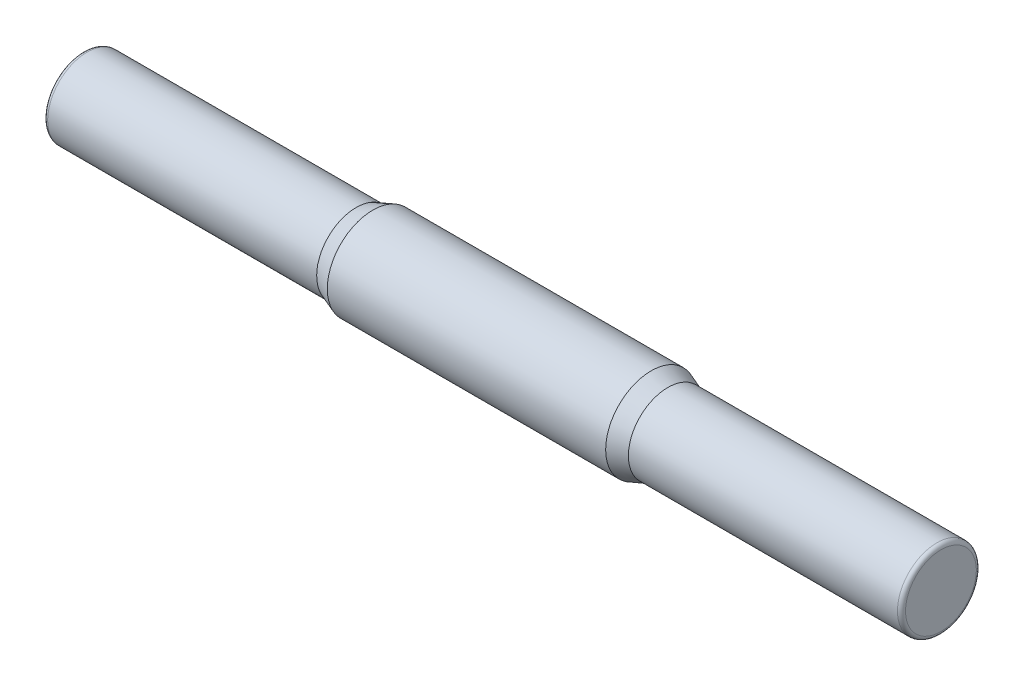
ISO-10303-21;
HEADER;
FILE_DESCRIPTION(('STEP AP214'),'2;1');
FILE_NAME('part.step','',(''),(''),'','','');
FILE_SCHEMA(('AUTOMOTIVE_DESIGN { 1 0 10303 214 1 1 1 1 }'));
ENDSEC;
DATA;
#1=APPLICATION_CONTEXT('core data for automotive mechanical design processes');
#2=APPLICATION_PROTOCOL_DEFINITION('international standard','automotive_design',2000,#1);
#3=PRODUCT_CONTEXT('',#1,'mechanical');
#4=PRODUCT('Part','Part','',(#3));
#5=PRODUCT_RELATED_PRODUCT_CATEGORY('part','',(#4));
#6=PRODUCT_DEFINITION_FORMATION('','',#4);
#7=PRODUCT_DEFINITION_CONTEXT('part definition',#1,'design');
#8=PRODUCT_DEFINITION('design','',#6,#7);
#9=PRODUCT_DEFINITION_SHAPE('','',#8);
#10=(LENGTH_UNIT() NAMED_UNIT(*) SI_UNIT(.MILLI.,.METRE.));
#11=(NAMED_UNIT(*) PLANE_ANGLE_UNIT() SI_UNIT($,.RADIAN.));
#12=(NAMED_UNIT(*) SI_UNIT($,.STERADIAN.) SOLID_ANGLE_UNIT());
#13=UNCERTAINTY_MEASURE_WITH_UNIT(LENGTH_MEASURE(1.E-05),#10,'distance_accuracy_value','');
#14=(GEOMETRIC_REPRESENTATION_CONTEXT(3) GLOBAL_UNCERTAINTY_ASSIGNED_CONTEXT((#13)) GLOBAL_UNIT_ASSIGNED_CONTEXT((#10,
#11,#12)) REPRESENTATION_CONTEXT('',''));
#15=CARTESIAN_POINT('',(0.,0.,0.));
#16=DIRECTION('',(0.,0.,1.));
#17=DIRECTION('',(1.,0.,0.));
#18=AXIS2_PLACEMENT_3D('',#15,#16,#17);
#19=CARTESIAN_POINT('',(-221.289884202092,867.201635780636,-91.985449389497));
#20=DIRECTION('',(-1.,0.,0.));
#21=DIRECTION('',(0.,-1.,0.));
#22=AXIS2_PLACEMENT_3D('',#19,#20,#21);
#23=CYLINDRICAL_SURFACE('',#22,17.5);
#24=CARTESIAN_POINT('',(-210.,867.201635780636,-91.985449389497));
#25=DIRECTION('',(-1.,0.,0.));
#26=DIRECTION('',(0.,-1.,0.));
#27=AXIS2_PLACEMENT_3D('',#24,#25,#26);
#28=CIRCLE('',#27,17.5);
#29=CARTESIAN_POINT('',(-210.,849.701635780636,-91.985449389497));
#30=VERTEX_POINT('',#29);
#31=EDGE_CURVE('E74',#30,#30,#28,.T.);
#32=ORIENTED_EDGE('',*,*,#31,.T.);
#33=EDGE_LOOP('',(#32));
#34=FACE_BOUND('',#33,.T.);
#35=CARTESIAN_POINT('',(-82.5252258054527,867.201635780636,-91.9854493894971));
#36=DIRECTION('',(-1.,0.,0.));
#37=DIRECTION('',(0.,-1.,0.));
#38=AXIS2_PLACEMENT_3D('',#35,#36,#37);
#39=CIRCLE('',#38,17.5);
#40=CARTESIAN_POINT('',(-82.5252258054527,849.701635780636,-91.9854493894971));
#41=VERTEX_POINT('',#40);
#42=EDGE_CURVE('E12',#41,#41,#39,.T.);
#43=ORIENTED_EDGE('',*,*,#42,.F.);
#44=EDGE_LOOP('',(#43));
#45=FACE_BOUND('',#44,.T.);
#46=ADVANCED_FACE('F55',(#34,#45),#23,.F.);
#47=CARTESIAN_POINT('',(-77.0302709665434,867.201635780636,-91.9854493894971));
#48=DIRECTION('',(1.,0.,0.));
#49=DIRECTION('',(0.,1.,0.));
#50=AXIS2_PLACEMENT_3D('',#47,#48,#49);
#51=CONICAL_SURFACE('',#50,19.5,0.349065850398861);
#52=ORIENTED_EDGE('',*,*,#42,.T.);
#53=EDGE_LOOP('',(#52));
#54=FACE_BOUND('',#53,.T.);
#55=CARTESIAN_POINT('',(-77.0302709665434,867.201635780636,-91.9854493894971));
#56=DIRECTION('',(-1.,0.,0.));
#57=DIRECTION('',(0.,-1.,0.));
#58=AXIS2_PLACEMENT_3D('',#55,#56,#57);
#59=CIRCLE('',#58,19.5);
#60=CARTESIAN_POINT('',(-77.0302709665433,847.701635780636,-91.9854493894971));
#61=VERTEX_POINT('',#60);
#62=EDGE_CURVE('E61',#61,#61,#59,.T.);
#63=ORIENTED_EDGE('',*,*,#62,.F.);
#64=EDGE_LOOP('',(#63));
#65=FACE_BOUND('',#64,.T.);
#66=ADVANCED_FACE('F91',(#54,#65),#51,.F.);
#67=CARTESIAN_POINT('',(-221.289884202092,867.201635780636,-91.985449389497));
#68=DIRECTION('',(-1.,0.,0.));
#69=DIRECTION('',(0.,-1.,0.));
#70=AXIS2_PLACEMENT_3D('',#67,#68,#69);
#71=CYLINDRICAL_SURFACE('',#70,19.5);
#72=ORIENTED_EDGE('',*,*,#62,.T.);
#73=EDGE_LOOP('',(#72));
#74=FACE_BOUND('',#73,.T.);
#75=CARTESIAN_POINT('',(-210.,867.201635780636,-91.985449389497));
#76=DIRECTION('',(-1.,0.,0.));
#77=DIRECTION('',(0.,-1.,0.));
#78=AXIS2_PLACEMENT_3D('',#75,#76,#77);
#79=CIRCLE('',#78,19.5);
#80=CARTESIAN_POINT('',(-210.,847.701635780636,-91.985449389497));
#81=VERTEX_POINT('',#80);
#82=EDGE_CURVE('E65',#81,#81,#79,.T.);
#83=ORIENTED_EDGE('',*,*,#82,.F.);
#84=EDGE_LOOP('',(#83));
#85=FACE_BOUND('',#84,.T.);
#86=ADVANCED_FACE('F95',(#74,#85),#71,.T.);
#87=CARTESIAN_POINT('',(-210.,867.201635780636,-91.985449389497));
#88=DIRECTION('',(-1.,0.,0.));
#89=DIRECTION('',(0.,-1.,0.));
#90=AXIS2_PLACEMENT_3D('',#87,#88,#89);
#91=TOROIDAL_SURFACE('',#90,17.5,2.);
#92=ORIENTED_EDGE('',*,*,#82,.T.);
#93=EDGE_LOOP('',(#92));
#94=FACE_BOUND('',#93,.T.);
#95=CARTESIAN_POINT('',(-212.,867.201635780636,-91.985449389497));
#96=DIRECTION('',(-1.,0.,0.));
#97=DIRECTION('',(0.,-1.,0.));
#98=AXIS2_PLACEMENT_3D('',#95,#96,#97);
#99=CIRCLE('',#98,17.5);
#100=CARTESIAN_POINT('',(-212.,849.701635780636,-91.985449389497));
#101=VERTEX_POINT('',#100);
#102=EDGE_CURVE('E69',#101,#101,#99,.T.);
#103=ORIENTED_EDGE('',*,*,#102,.F.);
#104=EDGE_LOOP('',(#103));
#105=FACE_BOUND('',#104,.T.);
#106=ADVANCED_FACE('F87',(#94,#105),#91,.T.);
#107=CARTESIAN_POINT('',(-212.,867.201635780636,-91.985449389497));
#108=DIRECTION('',(-1.,0.,0.));
#109=DIRECTION('',(0.,-1.,0.));
#110=AXIS2_PLACEMENT_3D('',#107,#108,#109);
#111=PLANE('',#110);
#112=ORIENTED_EDGE('',*,*,#102,.T.);
#113=EDGE_LOOP('',(#112));
#114=FACE_BOUND('',#113,.T.);
#115=ADVANCED_FACE('F82',(#114),#111,.T.);
#116=CARTESIAN_POINT('',(-210.,867.201635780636,-91.985449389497));
#117=DIRECTION('',(1.,0.,0.));
#118=DIRECTION('',(0.,1.,0.));
#119=AXIS2_PLACEMENT_3D('',#116,#117,#118);
#120=PLANE('',#119);
#121=ORIENTED_EDGE('',*,*,#31,.F.);
#122=EDGE_LOOP('',(#121));
#123=FACE_BOUND('',#122,.T.);
#124=ADVANCED_FACE('F80',(#123),#120,.T.);
#125=CLOSED_SHELL('',(#46,#66,#86,#106,#115,#124));
#126=MANIFOLD_SOLID_BREP('B2',#125);
#127=CARTESIAN_POINT('',(210.,867.201635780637,-91.9854493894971));
#128=DIRECTION('',(-1.,0.,0.));
#129=DIRECTION('',(0.,0.,1.));
#130=AXIS2_PLACEMENT_3D('',#127,#128,#129);
#131=CYLINDRICAL_SURFACE('',#130,22.5);
#132=CARTESIAN_POINT('',(-68.7878387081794,867.201635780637,-91.9854493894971));
#133=DIRECTION('',(-1.,0.,0.));
#134=DIRECTION('',(0.,0.,1.));
#135=AXIS2_PLACEMENT_3D('',#132,#133,#134);
#136=CIRCLE('',#135,22.5);
#137=CARTESIAN_POINT('',(-68.7878387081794,867.201635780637,-69.4854493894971));
#138=VERTEX_POINT('',#137);
#139=EDGE_CURVE('E153',#138,#138,#136,.F.);
#140=ORIENTED_EDGE('',*,*,#139,.T.);
#141=EDGE_LOOP('',(#140));
#142=FACE_BOUND('',#141,.T.);
#143=CARTESIAN_POINT('',(68.7878387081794,867.201635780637,-91.9854493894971));
#144=DIRECTION('',(-1.,0.,0.));
#145=DIRECTION('',(0.,0.,1.));
#146=AXIS2_PLACEMENT_3D('',#143,#144,#145);
#147=CIRCLE('',#146,22.5);
#148=CARTESIAN_POINT('',(68.7878387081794,867.201635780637,-69.4854493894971));
#149=VERTEX_POINT('',#148);
#150=EDGE_CURVE('E157',#149,#149,#147,.T.);
#151=ORIENTED_EDGE('',*,*,#150,.T.);
#152=EDGE_LOOP('',(#151));
#153=FACE_BOUND('',#152,.T.);
#154=ADVANCED_FACE('F141',(#142,#153),#131,.T.);
#155=CARTESIAN_POINT('',(-110.,867.201635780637,-91.9854493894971));
#156=DIRECTION('',(-1.,0.,0.));
#157=DIRECTION('',(0.,0.,1.));
#158=AXIS2_PLACEMENT_3D('',#155,#156,#157);
#159=CYLINDRICAL_SURFACE('',#158,17.5);
#160=CARTESIAN_POINT('',(-82.5252258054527,867.201635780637,-91.9854493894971));
#161=DIRECTION('',(1.,0.,0.));
#162=DIRECTION('',(0.,0.,-1.));
#163=AXIS2_PLACEMENT_3D('',#160,#161,#162);
#164=CIRCLE('',#163,17.5);
#165=CARTESIAN_POINT('',(-82.5252258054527,867.201635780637,-109.485449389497));
#166=VERTEX_POINT('',#165);
#167=EDGE_CURVE('E149',#166,#166,#164,.F.);
#168=ORIENTED_EDGE('',*,*,#167,.T.);
#169=EDGE_LOOP('',(#168));
#170=FACE_BOUND('',#169,.T.);
#171=CARTESIAN_POINT('',(-210.,867.201635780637,-91.9854493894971));
#172=DIRECTION('',(-1.,0.,0.));
#173=DIRECTION('',(0.,0.,1.));
#174=AXIS2_PLACEMENT_3D('',#171,#172,#173);
#175=CIRCLE('',#174,17.5);
#176=CARTESIAN_POINT('',(-210.,867.201635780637,-74.4854493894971));
#177=VERTEX_POINT('',#176);
#178=EDGE_CURVE('E162',#177,#177,#175,.T.);
#179=ORIENTED_EDGE('',*,*,#178,.F.);
#180=EDGE_LOOP('',(#179));
#181=FACE_BOUND('',#180,.T.);
#182=ADVANCED_FACE('F187',(#170,#181),#159,.T.);
#183=CARTESIAN_POINT('',(-210.,867.201635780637,-91.9854493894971));
#184=DIRECTION('',(1.,0.,0.));
#185=DIRECTION('',(0.,0.,-1.));
#186=AXIS2_PLACEMENT_3D('',#183,#184,#185);
#187=PLANE('',#186);
#188=ORIENTED_EDGE('',*,*,#178,.T.);
#189=EDGE_LOOP('',(#188));
#190=FACE_BOUND('',#189,.T.);
#191=ADVANCED_FACE('F193',(#190),#187,.F.);
#192=CARTESIAN_POINT('',(68.7878387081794,867.201635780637,-91.9854493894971));
#193=DIRECTION('',(-1.,0.,0.));
#194=DIRECTION('',(0.,0.,1.));
#195=AXIS2_PLACEMENT_3D('',#192,#193,#194);
#196=CONICAL_SURFACE('',#195,22.5,0.349065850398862);
#197=CARTESIAN_POINT('',(77.0302709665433,867.201635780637,-91.9854493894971));
#198=DIRECTION('',(-1.,0.,0.));
#199=DIRECTION('',(0.,0.,1.));
#200=AXIS2_PLACEMENT_3D('',#197,#198,#199);
#201=CIRCLE('',#200,19.5);
#202=CARTESIAN_POINT('',(77.0302709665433,867.201635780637,-72.4854493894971));
#203=VERTEX_POINT('',#202);
#204=EDGE_CURVE('E54',#203,#203,#201,.F.);
#205=CARTESIAN_POINT('',(77.0302709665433,867.201635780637,-72.4854493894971));
#206=CARTESIAN_POINT('',(76.9444122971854,867.201635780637,-72.4541993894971));
#207=CARTESIAN_POINT('',(76.8585536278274,867.201635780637,-72.4229493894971));
#208=CARTESIAN_POINT('',(76.6868362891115,867.201635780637,-72.3604493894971));
#209=CARTESIAN_POINT('',(76.6009776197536,867.201635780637,-72.3291993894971));
#210=CARTESIAN_POINT('',(76.4292602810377,867.201635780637,-72.2666993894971));
#211=CARTESIAN_POINT('',(76.3434016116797,867.201635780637,-72.2354493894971));
#212=CARTESIAN_POINT('',(76.1716842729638,867.201635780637,-72.1729493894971));
#213=CARTESIAN_POINT('',(76.0858256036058,867.201635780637,-72.1416993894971));
#214=CARTESIAN_POINT('',(75.9141082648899,867.201635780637,-72.0791993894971));
#215=CARTESIAN_POINT('',(75.8282495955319,867.201635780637,-72.0479493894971));
#216=CARTESIAN_POINT('',(75.656532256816,867.201635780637,-71.9854493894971));
#217=CARTESIAN_POINT('',(75.5706735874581,867.201635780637,-71.9541993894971));
#218=CARTESIAN_POINT('',(75.3989562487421,867.201635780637,-71.8916993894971));
#219=CARTESIAN_POINT('',(75.3130975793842,867.201635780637,-71.8604493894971));
#220=CARTESIAN_POINT('',(75.1413802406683,867.201635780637,-71.7979493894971));
#221=CARTESIAN_POINT('',(75.0555215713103,867.201635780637,-71.7666993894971));
#222=CARTESIAN_POINT('',(74.8838042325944,867.201635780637,-71.7041993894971));
#223=CARTESIAN_POINT('',(74.7979455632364,867.201635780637,-71.6729493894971));
#224=CARTESIAN_POINT('',(74.6262282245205,867.201635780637,-71.6104493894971));
#225=CARTESIAN_POINT('',(74.5403695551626,867.201635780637,-71.5791993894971));
#226=CARTESIAN_POINT('',(74.3686522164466,867.201635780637,-71.5166993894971));
#227=CARTESIAN_POINT('',(74.2827935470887,867.201635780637,-71.4854493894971));
#228=CARTESIAN_POINT('',(74.1110762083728,867.201635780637,-71.4229493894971));
#229=CARTESIAN_POINT('',(74.0252175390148,867.201635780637,-71.3916993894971));
#230=CARTESIAN_POINT('',(73.8535002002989,867.201635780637,-71.3291993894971));
#231=CARTESIAN_POINT('',(73.7676415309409,867.201635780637,-71.2979493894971));
#232=CARTESIAN_POINT('',(73.595924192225,867.201635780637,-71.2354493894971));
#233=CARTESIAN_POINT('',(73.5100655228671,867.201635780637,-71.2041993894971));
#234=CARTESIAN_POINT('',(73.3383481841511,867.201635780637,-71.1416993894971));
#235=CARTESIAN_POINT('',(73.2524895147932,867.201635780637,-71.1104493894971));
#236=CARTESIAN_POINT('',(73.0807721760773,867.201635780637,-71.0479493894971));
#237=CARTESIAN_POINT('',(72.9949135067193,867.201635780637,-71.0166993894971));
#238=CARTESIAN_POINT('',(72.8231961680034,867.201635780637,-70.9541993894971));
#239=CARTESIAN_POINT('',(72.7373374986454,867.201635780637,-70.9229493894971));
#240=CARTESIAN_POINT('',(72.5656201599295,867.201635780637,-70.8604493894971));
#241=CARTESIAN_POINT('',(72.4797614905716,867.201635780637,-70.8291993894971));
#242=CARTESIAN_POINT('',(72.3080441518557,867.201635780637,-70.7666993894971));
#243=CARTESIAN_POINT('',(72.2221854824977,867.201635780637,-70.7354493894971));
#244=CARTESIAN_POINT('',(72.0504681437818,867.201635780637,-70.6729493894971));
#245=CARTESIAN_POINT('',(71.9646094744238,867.201635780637,-70.6416993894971));
#246=CARTESIAN_POINT('',(71.7928921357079,867.201635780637,-70.5791993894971));
#247=CARTESIAN_POINT('',(71.70703346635,867.201635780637,-70.5479493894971));
#248=CARTESIAN_POINT('',(71.535316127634,867.201635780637,-70.4854493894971));
#249=CARTESIAN_POINT('',(71.4494574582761,867.201635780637,-70.4541993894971));
#250=CARTESIAN_POINT('',(71.2777401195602,867.201635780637,-70.3916993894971));
#251=CARTESIAN_POINT('',(71.1918814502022,867.201635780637,-70.3604493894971));
#252=CARTESIAN_POINT('',(71.0201641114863,867.201635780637,-70.2979493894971));
#253=CARTESIAN_POINT('',(70.9343054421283,867.201635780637,-70.2666993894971));
#254=CARTESIAN_POINT('',(70.7625881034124,867.201635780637,-70.2041993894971));
#255=CARTESIAN_POINT('',(70.6767294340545,867.201635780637,-70.1729493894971));
#256=CARTESIAN_POINT('',(70.5050120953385,867.201635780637,-70.1104493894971));
#257=CARTESIAN_POINT('',(70.4191534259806,867.201635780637,-70.0791993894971));
#258=CARTESIAN_POINT('',(70.2474360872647,867.201635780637,-70.0166993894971));
#259=CARTESIAN_POINT('',(70.1615774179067,867.201635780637,-69.9854493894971));
#260=CARTESIAN_POINT('',(69.9898600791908,867.201635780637,-69.9229493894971));
#261=CARTESIAN_POINT('',(69.9040014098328,867.201635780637,-69.8916993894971));
#262=CARTESIAN_POINT('',(69.7322840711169,867.201635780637,-69.8291993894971));
#263=CARTESIAN_POINT('',(69.646425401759,867.201635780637,-69.7979493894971));
#264=CARTESIAN_POINT('',(69.474708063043,867.201635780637,-69.7354493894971));
#265=CARTESIAN_POINT('',(69.3888493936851,867.201635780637,-69.7041993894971));
#266=CARTESIAN_POINT('',(69.2171320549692,867.201635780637,-69.6416993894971));
#267=CARTESIAN_POINT('',(69.1312733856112,867.201635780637,-69.6104493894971));
#268=CARTESIAN_POINT('',(68.9595560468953,867.201635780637,-69.5479493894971));
#269=CARTESIAN_POINT('',(68.8736973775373,867.201635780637,-69.5166993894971));
#270=CARTESIAN_POINT('',(68.7878387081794,867.201635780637,-69.4854493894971));
#271=B_SPLINE_CURVE_WITH_KNOTS('',3,(#205,#206,#207,#208,#209,#210,#211,#212,#213,#214,#215,
#216,#217,#218,#219,#220,#221,#222,#223,#224,#225,#226,#227,#228,#229,#230,#231,#232,#233,#234,
#235,#236,#237,#238,#239,#240,#241,#242,#243,#244,#245,#246,#247,#248,#249,#250,#251,#252,#253,
#254,#255,#256,#257,#258,#259,#260,#261,#262,#263,#264,#265,#266,#267,#268,#269,#270),
.UNSPECIFIED.,.F.,.F.,(4,2,2,2,2,2,2,2,2,2,2,2,2,2,2,2,2,2,2,2,2,2,2,2,2,2,2,2,2,2,2,2,4),(0.,
0.27410666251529,0.54821332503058,0.822319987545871,1.09642665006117,1.37053331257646,
1.64463997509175,1.91874663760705,2.19285330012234,2.46695996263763,2.74106662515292,
3.01517328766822,3.28927995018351,3.5633866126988,3.83749327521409,4.11159993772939,
4.38570660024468,4.65981326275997,4.93391992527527,5.20802658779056,5.48213325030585,
5.75623991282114,6.03034657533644,6.30445323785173,6.57855990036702,6.85266656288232,
7.12677322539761,7.4008798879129,7.67498655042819,7.94909321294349,8.22319987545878,
8.49730653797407,8.77141320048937),.UNSPECIFIED.);
#272=EDGE_CURVE('BSEAM197',#203,#149,#271,.T.);
#273=ORIENTED_EDGE('',*,*,#204,.F.);
#274=ORIENTED_EDGE('',*,*,#150,.F.);
#275=ORIENTED_EDGE('',*,*,#272,.T.);
#276=ORIENTED_EDGE('',*,*,#272,.F.);
#277=EDGE_LOOP('',(#273,#275,#274,#276));
#278=FACE_BOUND('',#277,.T.);
#279=ADVANCED_FACE('F197',(#278),#196,.T.);
#280=CARTESIAN_POINT('',(-110.,867.201635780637,-91.9854493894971));
#281=DIRECTION('',(1.,0.,0.));
#282=DIRECTION('',(0.,0.,-1.));
#283=AXIS2_PLACEMENT_3D('',#280,#281,#282);
#284=CONICAL_SURFACE('',#283,7.49999999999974,0.349065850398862);
#285=ORIENTED_EDGE('',*,*,#139,.F.);
#286=EDGE_LOOP('',(#285));
#287=FACE_BOUND('',#286,.T.);
#288=ORIENTED_EDGE('',*,*,#167,.F.);
#289=EDGE_LOOP('',(#288));
#290=FACE_BOUND('',#289,.T.);
#291=ADVANCED_FACE('F144',(#287,#290),#284,.T.);
#292=CARTESIAN_POINT('',(221.289884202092,867.201635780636,-91.985449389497));
#293=DIRECTION('',(1.,0.,0.));
#294=DIRECTION('',(0.,-1.,0.));
#295=AXIS2_PLACEMENT_3D('',#292,#293,#294);
#296=CYLINDRICAL_SURFACE('',#295,19.5);
#297=ORIENTED_EDGE('',*,*,#204,.T.);
#298=EDGE_LOOP('',(#297));
#299=FACE_BOUND('',#298,.T.);
#300=CARTESIAN_POINT('',(210.,867.201635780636,-91.985449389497));
#301=DIRECTION('',(-1.,0.,0.));
#302=DIRECTION('',(0.,-1.,0.));
#303=AXIS2_PLACEMENT_3D('',#300,#301,#302);
#304=CIRCLE('',#303,19.5);
#305=CARTESIAN_POINT('',(210.,847.701635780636,-91.985449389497));
#306=VERTEX_POINT('',#305);
#307=EDGE_CURVE('E168',#306,#306,#304,.T.);
#308=ORIENTED_EDGE('',*,*,#307,.T.);
#309=EDGE_LOOP('',(#308));
#310=FACE_BOUND('',#309,.T.);
#311=ADVANCED_FACE('F172',(#299,#310),#296,.T.);
#312=CARTESIAN_POINT('',(210.,867.201635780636,-91.985449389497));
#313=DIRECTION('',(1.,0.,0.));
#314=DIRECTION('',(0.,-1.,0.));
#315=AXIS2_PLACEMENT_3D('',#312,#313,#314);
#316=TOROIDAL_SURFACE('',#315,17.5,2.);
#317=ORIENTED_EDGE('',*,*,#307,.F.);
#318=EDGE_LOOP('',(#317));
#319=FACE_BOUND('',#318,.T.);
#320=CARTESIAN_POINT('',(212.,867.201635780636,-91.985449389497));
#321=DIRECTION('',(-1.,0.,0.));
#322=DIRECTION('',(0.,-1.,0.));
#323=AXIS2_PLACEMENT_3D('',#320,#321,#322);
#324=CIRCLE('',#323,17.5);
#325=CARTESIAN_POINT('',(212.,849.701635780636,-91.985449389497));
#326=VERTEX_POINT('',#325);
#327=EDGE_CURVE('E165',#326,#326,#324,.T.);
#328=ORIENTED_EDGE('',*,*,#327,.T.);
#329=EDGE_LOOP('',(#328));
#330=FACE_BOUND('',#329,.T.);
#331=ADVANCED_FACE('F174',(#319,#330),#316,.T.);
#332=CARTESIAN_POINT('',(212.,867.201635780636,-91.985449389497));
#333=DIRECTION('',(1.,0.,0.));
#334=DIRECTION('',(0.,-1.,0.));
#335=AXIS2_PLACEMENT_3D('',#332,#333,#334);
#336=PLANE('',#335);
#337=ORIENTED_EDGE('',*,*,#327,.F.);
#338=EDGE_LOOP('',(#337));
#339=FACE_BOUND('',#338,.T.);
#340=ADVANCED_FACE('F177',(#339),#336,.T.);
#341=CLOSED_SHELL('',(#154,#182,#191,#279,#291,#311,#331,#340));
#342=MANIFOLD_SOLID_BREP('B7',#341);
#343=ADVANCED_BREP_SHAPE_REPRESENTATION('',(#18,#126,#342),#14);
#344=SHAPE_DEFINITION_REPRESENTATION(#9,#343);
ENDSEC;
END-ISO-10303-21;
